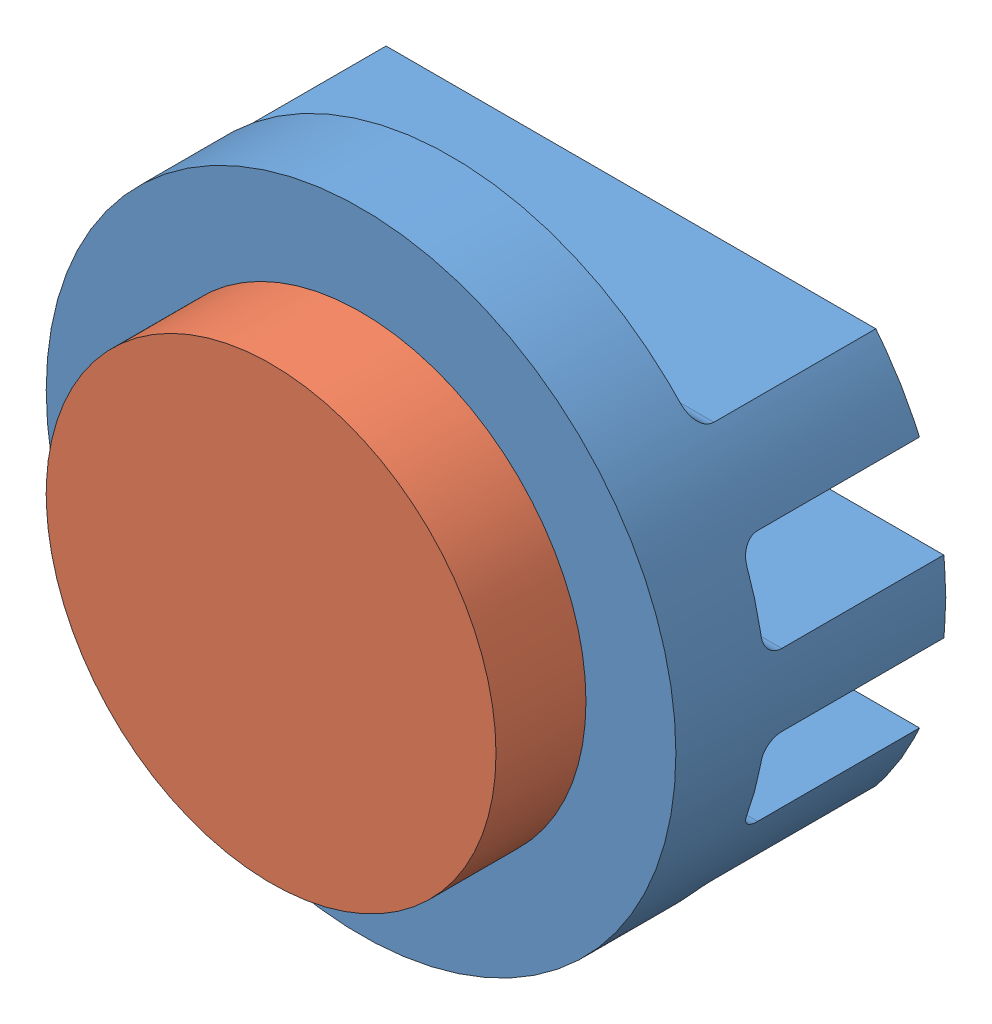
SolidWorks assembly HEAT SINK.SLDASM, configuration Default (file format 4100). Lengths in mm.
Overall size (70 70 40).
2 component instances, 2 part files, 3 mates.
Components (placement in the parent):
- radiator-1: radiator.SLDPRT [Default] at origin size (70 70 30)
- microchip-1: microchip.SLDPRT [Default] at (0 0 20) x (-1 0 0) z (0 0 -1) size (50 50 10)
Mates (geometry in assembly coordinates):
- Coincident2: coincident aligned: plane of radiator-1; plane of microchip-1
- Concentric1: concentric anti-aligned: cylinder of radiator-1; cylinder of microchip-1
- Coincident5: coincident anti-aligned: plane of radiator-1 through (0 0 10) normal (0 0 1); plane of microchip-1 through (0 0 10) normal (0 0 -1)
